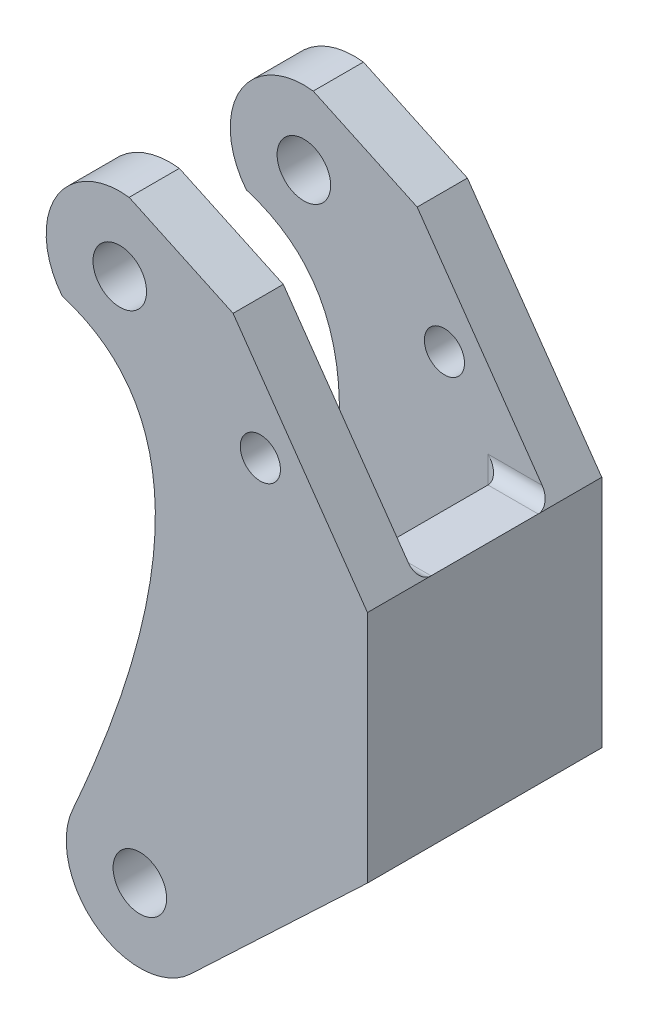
ISO-10303-21;
HEADER;
FILE_DESCRIPTION(('STEP AP214'),'2;1');
FILE_NAME('part.step','',(''),(''),'','','');
FILE_SCHEMA(('AUTOMOTIVE_DESIGN { 1 0 10303 214 1 1 1 1 }'));
ENDSEC;
DATA;
#1=APPLICATION_CONTEXT('core data for automotive mechanical design processes');
#2=APPLICATION_PROTOCOL_DEFINITION('international standard','automotive_design',2000,#1);
#3=PRODUCT_CONTEXT('',#1,'mechanical');
#4=PRODUCT('Part','Part','',(#3));
#5=PRODUCT_RELATED_PRODUCT_CATEGORY('part','',(#4));
#6=PRODUCT_DEFINITION_FORMATION('','',#4);
#7=PRODUCT_DEFINITION_CONTEXT('part definition',#1,'design');
#8=PRODUCT_DEFINITION('design','',#6,#7);
#9=PRODUCT_DEFINITION_SHAPE('','',#8);
#10=(LENGTH_UNIT() NAMED_UNIT(*) SI_UNIT(.MILLI.,.METRE.));
#11=(NAMED_UNIT(*) PLANE_ANGLE_UNIT() SI_UNIT($,.RADIAN.));
#12=(NAMED_UNIT(*) SI_UNIT($,.STERADIAN.) SOLID_ANGLE_UNIT());
#13=UNCERTAINTY_MEASURE_WITH_UNIT(LENGTH_MEASURE(1.E-05),#10,'distance_accuracy_value','');
#14=(GEOMETRIC_REPRESENTATION_CONTEXT(3) GLOBAL_UNCERTAINTY_ASSIGNED_CONTEXT((#13)) GLOBAL_UNIT_ASSIGNED_CONTEXT((#10,
#11,#12)) REPRESENTATION_CONTEXT('',''));
#15=CARTESIAN_POINT('',(0.,0.,0.));
#16=DIRECTION('',(0.,0.,1.));
#17=DIRECTION('',(1.,0.,0.));
#18=AXIS2_PLACEMENT_3D('',#15,#16,#17);
#19=CARTESIAN_POINT('',(-733376.145202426,-679839.483721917,35.));
#20=CARTESIAN_POINT('',(729354.890660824,684144.097201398,35.));
#21=CARTESIAN_POINT('',(-725481.74701469,-688256.591366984,35.));
#22=B_SPLINE_CURVE_WITH_KNOTS('',2,(#19,#20,#21),.UNSPECIFIED.,.F.,.F.,(3,3),(0.,1.),.UNSPECIFIED.);
#23=DIRECTION('',(0.,0.,-1.));
#24=VECTOR('',#23,1.);
#25=SURFACE_OF_LINEAR_EXTRUSION('',#22,#24);
#26=CARTESIAN_POINT('',(-733376.145202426,-679839.483721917,27.5));
#27=CARTESIAN_POINT('',(729354.890660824,684144.097201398,27.5));
#28=CARTESIAN_POINT('',(-725481.74701469,-688256.591366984,27.5));
#29=B_SPLINE_CURVE_WITH_KNOTS('',2,(#26,#27,#28),.UNSPECIFIED.,.F.,.F.,(3,3),(0.,1.),.UNSPECIFIED.);
#30=CARTESIAN_POINT('',(-45.5921431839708,53.1315885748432,27.5));
#31=VERTEX_POINT('',#30);
#32=CARTESIAN_POINT('',(-44.033482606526,-12.4912056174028,27.5));
#33=VERTEX_POINT('',#32);
#34=EDGE_CURVE('E233',#31,#33,#29,.T.);
#35=ORIENTED_EDGE('',*,*,#34,.T.);
#36=DIRECTION('',(0.,0.,-1.));
#37=VECTOR('',#36,1.);
#38=CARTESIAN_POINT('',(-44.0334826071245,-12.4912056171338,35.));
#39=LINE('',#38,#37);
#40=CARTESIAN_POINT('',(-44.0334826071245,-12.4912056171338,35.));
#41=VERTEX_POINT('',#40);
#42=EDGE_CURVE('E206',#41,#33,#39,.T.);
#43=ORIENTED_EDGE('',*,*,#42,.F.);
#44=CARTESIAN_POINT('',(-45.5921431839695,53.1315885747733,35.));
#45=VERTEX_POINT('',#44);
#46=EDGE_CURVE('E196',#45,#41,#22,.T.);
#47=ORIENTED_EDGE('',*,*,#46,.F.);
#48=DIRECTION('',(0.,0.,-1.));
#49=VECTOR('',#48,1.);
#50=CARTESIAN_POINT('',(-45.5921431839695,53.1315885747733,35.));
#51=LINE('',#50,#49);
#52=EDGE_CURVE('E213',#45,#31,#51,.T.);
#53=ORIENTED_EDGE('',*,*,#52,.T.);
#54=EDGE_LOOP('',(#35,#43,#47,#53));
#55=FACE_BOUND('',#54,.T.);
#56=ADVANCED_FACE('F31',(#55),#25,.F.);
#57=CARTESIAN_POINT('',(0.,0.,35.));
#58=DIRECTION('',(-0.686903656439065,0.726748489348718,0.));
#59=DIRECTION('',(-0.726748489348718,-0.686903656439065,0.));
#60=AXIS2_PLACEMENT_3D('',#57,#58,#59);
#61=PLANE('',#60);
#62=DIRECTION('',(0.,0.,-1.));
#63=VECTOR('',#62,1.);
#64=CARTESIAN_POINT('',(-26.4440597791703,-24.9942333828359,35.));
#65=LINE('',#64,#63);
#66=CARTESIAN_POINT('',(-26.4440597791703,-24.9942333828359,35.));
#67=VERTEX_POINT('',#66);
#68=CARTESIAN_POINT('',(-26.4440597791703,-24.9942333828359,27.5));
#69=VERTEX_POINT('',#68);
#70=EDGE_CURVE('E195',#67,#69,#65,.T.);
#71=ORIENTED_EDGE('',*,*,#70,.T.);
#72=DIRECTION('',(0.726748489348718,0.686903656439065,0.));
#73=VECTOR('',#72,1.);
#74=CARTESIAN_POINT('',(0.,0.,27.5));
#75=LINE('',#74,#73);
#76=CARTESIAN_POINT('',(-2.11601287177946,-2.,27.5));
#77=VERTEX_POINT('',#76);
#78=EDGE_CURVE('E418',#69,#77,#75,.T.);
#79=ORIENTED_EDGE('',*,*,#78,.T.);
#80=CARTESIAN_POINT('',(-2.11601287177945,-2.,25.5));
#81=DIRECTION('',(-0.686903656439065,0.726748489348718,0.));
#82=DIRECTION('',(-0.726748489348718,-0.686903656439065,0.));
#83=AXIS2_PLACEMENT_3D('',#80,#81,#82);
#84=ELLIPSE('',#83,2.91161647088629,2.);
#85=CARTESIAN_POINT('',(0.,0.,25.5));
#86=VERTEX_POINT('',#85);
#87=EDGE_CURVE('E286',#77,#86,#84,.T.);
#88=ORIENTED_EDGE('',*,*,#87,.T.);
#89=DIRECTION('',(0.,0.,-1.));
#90=VECTOR('',#89,1.);
#91=CARTESIAN_POINT('',(0.,0.,35.));
#92=LINE('',#91,#90);
#93=CARTESIAN_POINT('',(0.,0.,35.));
#94=VERTEX_POINT('',#93);
#95=EDGE_CURVE('E227',#94,#86,#92,.T.);
#96=ORIENTED_EDGE('',*,*,#95,.F.);
#97=DIRECTION('',(0.726748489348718,0.686903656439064,0.));
#98=VECTOR('',#97,1.);
#99=CARTESIAN_POINT('',(0.,0.,35.));
#100=LINE('',#99,#98);
#101=EDGE_CURVE('E338',#67,#94,#100,.T.);
#102=ORIENTED_EDGE('',*,*,#101,.F.);
#103=EDGE_LOOP('',(#71,#79,#88,#96,#102));
#104=FACE_BOUND('',#103,.T.);
#105=ADVANCED_FACE('F381',(#104),#61,.F.);
#106=CARTESIAN_POINT('',(-34.,-17.,35.));
#107=DIRECTION('',(0.,0.,-1.));
#108=DIRECTION('',(-1.,0.,0.));
#109=AXIS2_PLACEMENT_3D('',#106,#107,#108);
#110=CYLINDRICAL_SURFACE('',#109,11.);
#111=ORIENTED_EDGE('',*,*,#42,.T.);
#112=CARTESIAN_POINT('',(-34.,-17.,27.5));
#113=DIRECTION('',(0.,0.,1.));
#114=DIRECTION('',(1.,0.,0.));
#115=AXIS2_PLACEMENT_3D('',#112,#113,#114);
#116=CIRCLE('',#115,11.);
#117=EDGE_CURVE('E245',#33,#69,#116,.T.);
#118=ORIENTED_EDGE('',*,*,#117,.T.);
#119=ORIENTED_EDGE('',*,*,#70,.F.);
#120=CARTESIAN_POINT('',(-34.,-17.,35.));
#121=DIRECTION('',(0.,0.,1.));
#122=DIRECTION('',(1.,0.,0.));
#123=AXIS2_PLACEMENT_3D('',#120,#121,#122);
#124=CIRCLE('',#123,11.);
#125=EDGE_CURVE('E193',#41,#67,#124,.T.);
#126=ORIENTED_EDGE('',*,*,#125,.F.);
#127=EDGE_LOOP('',(#111,#118,#119,#126));
#128=FACE_BOUND('',#127,.T.);
#129=ADVANCED_FACE('F408',(#128),#110,.T.);
#130=CARTESIAN_POINT('',(0.,35.,35.));
#131=DIRECTION('',(-0.819152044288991,-0.573576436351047,0.));
#132=DIRECTION('',(0.573576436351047,-0.819152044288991,0.));
#133=AXIS2_PLACEMENT_3D('',#130,#131,#132);
#134=PLANE('',#133);
#135=DIRECTION('',(0.,0.,-1.));
#136=VECTOR('',#135,1.);
#137=CARTESIAN_POINT('',(0.,35.,35.));
#138=LINE('',#137,#136);
#139=CARTESIAN_POINT('',(0.,35.,35.));
#140=VERTEX_POINT('',#139);
#141=CARTESIAN_POINT('',(0.,35.,25.5));
#142=VERTEX_POINT('',#141);
#143=EDGE_CURVE('E224',#140,#142,#138,.T.);
#144=ORIENTED_EDGE('',*,*,#143,.T.);
#145=CARTESIAN_POINT('',(-1.40041507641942,37.,25.5));
#146=DIRECTION('',(-0.819152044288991,-0.573576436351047,0.));
#147=DIRECTION('',(-0.573576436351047,0.819152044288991,0.));
#148=AXIS2_PLACEMENT_3D('',#145,#146,#147);
#149=ELLIPSE('',#148,2.44154917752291,2.);
#150=CARTESIAN_POINT('',(-1.40041507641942,37.,27.5));
#151=VERTEX_POINT('',#150);
#152=EDGE_CURVE('E284',#142,#151,#149,.T.);
#153=ORIENTED_EDGE('',*,*,#152,.T.);
#154=DIRECTION('',(-0.573576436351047,0.819152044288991,0.));
#155=VECTOR('',#154,1.);
#156=CARTESIAN_POINT('',(0.,35.,27.5));
#157=LINE('',#156,#155);
#158=CARTESIAN_POINT('',(-20.0751752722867,63.6703215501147,27.5));
#159=VERTEX_POINT('',#158);
#160=EDGE_CURVE('E335',#151,#159,#157,.T.);
#161=ORIENTED_EDGE('',*,*,#160,.T.);
#162=DIRECTION('',(0.,0.,-1.));
#163=VECTOR('',#162,1.);
#164=CARTESIAN_POINT('',(-20.0751752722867,63.6703215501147,35.));
#165=LINE('',#164,#163);
#166=CARTESIAN_POINT('',(-20.0751752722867,63.6703215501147,35.));
#167=VERTEX_POINT('',#166);
#168=EDGE_CURVE('E221',#167,#159,#165,.T.);
#169=ORIENTED_EDGE('',*,*,#168,.F.);
#170=DIRECTION('',(-0.573576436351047,0.819152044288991,0.));
#171=VECTOR('',#170,1.);
#172=CARTESIAN_POINT('',(0.,35.,35.));
#173=LINE('',#172,#171);
#174=EDGE_CURVE('E343',#140,#167,#173,.T.);
#175=ORIENTED_EDGE('',*,*,#174,.F.);
#176=EDGE_LOOP('',(#144,#153,#161,#169,#175));
#177=FACE_BOUND('',#176,.T.);
#178=ADVANCED_FACE('F376',(#177),#134,.F.);
#179=CARTESIAN_POINT('',(-20.0751752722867,63.6703215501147,35.));
#180=DIRECTION('',(-0.422618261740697,-0.906307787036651,0.));
#181=DIRECTION('',(0.906307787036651,-0.422618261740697,0.));
#182=AXIS2_PLACEMENT_3D('',#179,#180,#181);
#183=PLANE('',#182);
#184=ORIENTED_EDGE('',*,*,#168,.T.);
#185=DIRECTION('',(-0.906307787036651,0.422618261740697,0.));
#186=VECTOR('',#185,1.);
#187=CARTESIAN_POINT('',(-20.0751752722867,63.6703215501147,27.5));
#188=LINE('',#187,#186);
#189=CARTESIAN_POINT('',(-35.6026001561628,70.9108786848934,27.5));
#190=VERTEX_POINT('',#189);
#191=EDGE_CURVE('E327',#159,#190,#188,.T.);
#192=ORIENTED_EDGE('',*,*,#191,.T.);
#193=DIRECTION('',(0.,0.,-1.));
#194=VECTOR('',#193,1.);
#195=CARTESIAN_POINT('',(-35.6026001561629,70.9108786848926,35.));
#196=LINE('',#195,#194);
#197=CARTESIAN_POINT('',(-35.6026001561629,70.9108786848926,35.));
#198=VERTEX_POINT('',#197);
#199=EDGE_CURVE('E217',#198,#190,#196,.T.);
#200=ORIENTED_EDGE('',*,*,#199,.F.);
#201=DIRECTION('',(-0.906307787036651,0.422618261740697,0.));
#202=VECTOR('',#201,1.);
#203=CARTESIAN_POINT('',(-20.0751752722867,63.6703215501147,35.));
#204=LINE('',#203,#202);
#205=EDGE_CURVE('E345',#167,#198,#204,.T.);
#206=ORIENTED_EDGE('',*,*,#205,.F.);
#207=EDGE_LOOP('',(#184,#192,#200,#206));
#208=FACE_BOUND('',#207,.T.);
#209=ADVANCED_FACE('F372',(#208),#183,.F.);
#210=CARTESIAN_POINT('',(-37.,60.,35.));
#211=DIRECTION('',(0.,0.,-1.));
#212=DIRECTION('',(-1.,0.,0.));
#213=AXIS2_PLACEMENT_3D('',#210,#211,#212);
#214=CYLINDRICAL_SURFACE('',#213,11.0000000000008);
#215=CARTESIAN_POINT('',(-37.,60.,7.5));
#216=DIRECTION('',(0.,0.,-1.));
#217=DIRECTION('',(-1.,0.,0.));
#218=AXIS2_PLACEMENT_3D('',#215,#216,#217);
#219=CIRCLE('',#218,11.0000000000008);
#220=CARTESIAN_POINT('',(-45.5921431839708,53.1315885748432,7.5));
#221=VERTEX_POINT('',#220);
#222=CARTESIAN_POINT('',(-35.6026001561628,70.9108786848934,7.5));
#223=VERTEX_POINT('',#222);
#224=EDGE_CURVE('E329',#221,#223,#219,.T.);
#225=ORIENTED_EDGE('',*,*,#224,.T.);
#226=CARTESIAN_POINT('',(-35.6026001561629,70.9108786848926,0.));
#227=VERTEX_POINT('',#226);
#228=EDGE_CURVE('E216',#223,#227,#196,.T.);
#229=ORIENTED_EDGE('',*,*,#228,.T.);
#230=CARTESIAN_POINT('',(-37.,60.,0.));
#231=DIRECTION('',(0.,0.,1.));
#232=DIRECTION('',(1.,0.,0.));
#233=AXIS2_PLACEMENT_3D('',#230,#231,#232);
#234=CIRCLE('',#233,11.0000000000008);
#235=CARTESIAN_POINT('',(-45.5921431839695,53.1315885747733,0.));
#236=VERTEX_POINT('',#235);
#237=EDGE_CURVE('E459',#227,#236,#234,.T.);
#238=ORIENTED_EDGE('',*,*,#237,.T.);
#239=EDGE_CURVE('E211',#221,#236,#51,.T.);
#240=ORIENTED_EDGE('',*,*,#239,.F.);
#241=EDGE_LOOP('',(#225,#229,#238,#240));
#242=FACE_BOUND('',#241,.T.);
#243=ADVANCED_FACE('F368',(#242),#214,.T.);
#244=CARTESIAN_POINT('',(-26.4440597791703,-24.9942333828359,7.5));
#245=VERTEX_POINT('',#244);
#246=CARTESIAN_POINT('',(-26.4440597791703,-24.9942333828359,6.25));
#247=VERTEX_POINT('',#246);
#248=EDGE_CURVE('E186',#245,#247,#65,.T.);
#249=ORIENTED_EDGE('',*,*,#248,.T.);
#250=CARTESIAN_POINT('',(-26.4440597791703,-24.9942333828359,3.75));
#251=DIRECTION('',(0.686903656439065,-0.726748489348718,0.));
#252=DIRECTION('',(0.726748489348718,0.686903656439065,0.));
#253=AXIS2_PLACEMENT_3D('',#250,#251,#252);
#254=CIRCLE('',#253,2.5);
#255=CARTESIAN_POINT('',(-26.4440597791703,-24.9942333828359,1.25));
#256=VERTEX_POINT('',#255);
#257=EDGE_CURVE('E47',#256,#247,#254,.T.);
#258=ORIENTED_EDGE('',*,*,#257,.F.);
#259=CARTESIAN_POINT('',(-26.4440597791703,-24.9942333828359,0.));
#260=VERTEX_POINT('',#259);
#261=EDGE_CURVE('E184',#256,#260,#65,.T.);
#262=ORIENTED_EDGE('',*,*,#261,.T.);
#263=DIRECTION('',(0.726748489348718,0.686903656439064,0.));
#264=VECTOR('',#263,1.);
#265=CARTESIAN_POINT('',(0.,0.,0.));
#266=LINE('',#265,#264);
#267=CARTESIAN_POINT('',(0.,0.,0.));
#268=VERTEX_POINT('',#267);
#269=EDGE_CURVE('E337',#260,#268,#266,.T.);
#270=ORIENTED_EDGE('',*,*,#269,.T.);
#271=CARTESIAN_POINT('',(0.,0.,9.5));
#272=VERTEX_POINT('',#271);
#273=EDGE_CURVE('E226',#272,#268,#92,.T.);
#274=ORIENTED_EDGE('',*,*,#273,.F.);
#275=CARTESIAN_POINT('',(-2.11601287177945,-2.,9.5));
#276=DIRECTION('',(-0.686903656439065,0.726748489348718,0.));
#277=DIRECTION('',(-0.726748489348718,-0.686903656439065,0.));
#278=AXIS2_PLACEMENT_3D('',#275,#276,#277);
#279=ELLIPSE('',#278,2.91161647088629,2.);
#280=CARTESIAN_POINT('',(-2.11601287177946,-2.,7.5));
#281=VERTEX_POINT('',#280);
#282=EDGE_CURVE('E40',#272,#281,#279,.T.);
#283=ORIENTED_EDGE('',*,*,#282,.T.);
#284=DIRECTION('',(-0.726748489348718,-0.686903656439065,0.));
#285=VECTOR('',#284,1.);
#286=CARTESIAN_POINT('',(0.,0.,7.5));
#287=LINE('',#286,#285);
#288=EDGE_CURVE('E442',#281,#245,#287,.T.);
#289=ORIENTED_EDGE('',*,*,#288,.T.);
#290=EDGE_LOOP('',(#249,#258,#262,#270,#274,#283,#289));
#291=FACE_BOUND('',#290,.T.);
#292=ADVANCED_FACE('F182',(#291),#61,.F.);
#293=CARTESIAN_POINT('',(0.,0.,35.));
#294=DIRECTION('',(-1.,0.,0.));
#295=DIRECTION('',(0.,0.,1.));
#296=AXIS2_PLACEMENT_3D('',#293,#294,#295);
#297=PLANE('',#296);
#298=DIRECTION('',(0.,1.,0.));
#299=VECTOR('',#298,1.);
#300=CARTESIAN_POINT('',(0.,0.,0.));
#301=LINE('',#300,#299);
#302=CARTESIAN_POINT('',(0.,35.,0.));
#303=VERTEX_POINT('',#302);
#304=EDGE_CURVE('E474',#268,#303,#301,.T.);
#305=ORIENTED_EDGE('',*,*,#304,.T.);
#306=CARTESIAN_POINT('',(0.,35.,9.5));
#307=VERTEX_POINT('',#306);
#308=EDGE_CURVE('E55',#307,#303,#138,.T.);
#309=ORIENTED_EDGE('',*,*,#308,.F.);
#310=DIRECTION('',(0.,0.,-1.));
#311=VECTOR('',#310,1.);
#312=CARTESIAN_POINT('',(0.,35.,27.5));
#313=LINE('',#312,#311);
#314=EDGE_CURVE('E441',#142,#307,#313,.T.);
#315=ORIENTED_EDGE('',*,*,#314,.F.);
#316=ORIENTED_EDGE('',*,*,#143,.F.);
#317=DIRECTION('',(0.,1.,0.));
#318=VECTOR('',#317,1.);
#319=CARTESIAN_POINT('',(0.,0.,35.));
#320=LINE('',#319,#318);
#321=EDGE_CURVE('E341',#94,#140,#320,.T.);
#322=ORIENTED_EDGE('',*,*,#321,.F.);
#323=ORIENTED_EDGE('',*,*,#95,.T.);
#324=DIRECTION('',(0.,0.,1.));
#325=VECTOR('',#324,1.);
#326=CARTESIAN_POINT('',(0.,0.,27.5));
#327=LINE('',#326,#325);
#328=EDGE_CURVE('E445',#272,#86,#327,.T.);
#329=ORIENTED_EDGE('',*,*,#328,.F.);
#330=ORIENTED_EDGE('',*,*,#273,.T.);
#331=EDGE_LOOP('',(#305,#309,#315,#316,#322,#323,#329,#330));
#332=FACE_BOUND('',#331,.T.);
#333=ADVANCED_FACE('F375',(#332),#297,.F.);
#334=CARTESIAN_POINT('',(-20.0751752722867,63.6703215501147,7.5));
#335=VERTEX_POINT('',#334);
#336=CARTESIAN_POINT('',(-20.0751752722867,63.6703215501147,0.));
#337=VERTEX_POINT('',#336);
#338=EDGE_CURVE('E220',#335,#337,#165,.T.);
#339=ORIENTED_EDGE('',*,*,#338,.F.);
#340=DIRECTION('',(0.573576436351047,-0.819152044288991,0.));
#341=VECTOR('',#340,1.);
#342=CARTESIAN_POINT('',(0.,35.,7.5));
#343=LINE('',#342,#341);
#344=CARTESIAN_POINT('',(-1.40041507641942,37.,7.5));
#345=VERTEX_POINT('',#344);
#346=EDGE_CURVE('E318',#335,#345,#343,.T.);
#347=ORIENTED_EDGE('',*,*,#346,.T.);
#348=CARTESIAN_POINT('',(-1.40041507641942,37.,9.5));
#349=DIRECTION('',(-0.819152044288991,-0.573576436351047,0.));
#350=DIRECTION('',(-0.573576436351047,0.819152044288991,0.));
#351=AXIS2_PLACEMENT_3D('',#348,#349,#350);
#352=ELLIPSE('',#351,2.44154917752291,2.);
#353=EDGE_CURVE('E11',#345,#307,#352,.T.);
#354=ORIENTED_EDGE('',*,*,#353,.T.);
#355=ORIENTED_EDGE('',*,*,#308,.T.);
#356=DIRECTION('',(-0.573576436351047,0.819152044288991,0.));
#357=VECTOR('',#356,1.);
#358=CARTESIAN_POINT('',(0.,35.,0.));
#359=LINE('',#358,#357);
#360=EDGE_CURVE('E460',#303,#337,#359,.T.);
#361=ORIENTED_EDGE('',*,*,#360,.T.);
#362=EDGE_LOOP('',(#339,#347,#354,#355,#361));
#363=FACE_BOUND('',#362,.T.);
#364=ADVANCED_FACE('F322',(#363),#134,.F.);
#365=ORIENTED_EDGE('',*,*,#228,.F.);
#366=DIRECTION('',(0.906307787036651,-0.422618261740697,0.));
#367=VECTOR('',#366,1.);
#368=CARTESIAN_POINT('',(-20.0751752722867,63.6703215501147,7.5));
#369=LINE('',#368,#367);
#370=EDGE_CURVE('E325',#223,#335,#369,.T.);
#371=ORIENTED_EDGE('',*,*,#370,.T.);
#372=ORIENTED_EDGE('',*,*,#338,.T.);
#373=DIRECTION('',(-0.906307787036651,0.422618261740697,0.));
#374=VECTOR('',#373,1.);
#375=CARTESIAN_POINT('',(-20.0751752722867,63.6703215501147,0.));
#376=LINE('',#375,#374);
#377=EDGE_CURVE('E455',#337,#227,#376,.T.);
#378=ORIENTED_EDGE('',*,*,#377,.T.);
#379=EDGE_LOOP('',(#365,#371,#372,#378));
#380=FACE_BOUND('',#379,.T.);
#381=ADVANCED_FACE('F366',(#380),#183,.F.);
#382=CARTESIAN_POINT('',(-37.,60.,27.5));
#383=DIRECTION('',(0.,0.,1.));
#384=DIRECTION('',(1.,0.,0.));
#385=AXIS2_PLACEMENT_3D('',#382,#383,#384);
#386=CIRCLE('',#385,11.0000000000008);
#387=EDGE_CURVE('E324',#190,#31,#386,.T.);
#388=ORIENTED_EDGE('',*,*,#387,.T.);
#389=ORIENTED_EDGE('',*,*,#52,.F.);
#390=CARTESIAN_POINT('',(-37.,60.,35.));
#391=DIRECTION('',(0.,0.,1.));
#392=DIRECTION('',(1.,0.,0.));
#393=AXIS2_PLACEMENT_3D('',#390,#391,#392);
#394=CIRCLE('',#393,11.0000000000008);
#395=EDGE_CURVE('E347',#198,#45,#394,.T.);
#396=ORIENTED_EDGE('',*,*,#395,.F.);
#397=ORIENTED_EDGE('',*,*,#199,.T.);
#398=EDGE_LOOP('',(#388,#389,#396,#397));
#399=FACE_BOUND('',#398,.T.);
#400=ADVANCED_FACE('F361',(#399),#214,.T.);
#401=CARTESIAN_POINT('',(-44.0334826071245,-12.4912056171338,7.5));
#402=VERTEX_POINT('',#401);
#403=CARTESIAN_POINT('',(-44.0334826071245,-12.4912056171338,0.));
#404=VERTEX_POINT('',#403);
#405=EDGE_CURVE('E201',#402,#404,#39,.T.);
#406=ORIENTED_EDGE('',*,*,#405,.F.);
#407=CARTESIAN_POINT('',(-733376.145202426,-679839.483721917,7.5));
#408=CARTESIAN_POINT('',(729354.890660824,684144.097201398,7.5));
#409=CARTESIAN_POINT('',(-725481.74701469,-688256.591366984,7.5));
#410=B_SPLINE_CURVE_WITH_KNOTS('',2,(#407,#408,#409),.UNSPECIFIED.,.F.,.F.,(3,3),(0.,1.),.UNSPECIFIED.);
#411=EDGE_CURVE('E229',#402,#221,#410,.F.);
#412=ORIENTED_EDGE('',*,*,#411,.T.);
#413=ORIENTED_EDGE('',*,*,#239,.T.);
#414=CARTESIAN_POINT('',(-733376.145202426,-679839.483721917,0.));
#415=CARTESIAN_POINT('',(729354.890660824,684144.097201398,0.));
#416=CARTESIAN_POINT('',(-725481.74701469,-688256.591366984,0.));
#417=B_SPLINE_CURVE_WITH_KNOTS('',2,(#414,#415,#416),.UNSPECIFIED.,.F.,.F.,(3,3),(0.,1.),.UNSPECIFIED.);
#418=EDGE_CURVE('E464',#236,#404,#417,.T.);
#419=ORIENTED_EDGE('',*,*,#418,.T.);
#420=EDGE_LOOP('',(#406,#412,#413,#419));
#421=FACE_BOUND('',#420,.T.);
#422=ADVANCED_FACE('F357',(#421),#25,.F.);
#423=ORIENTED_EDGE('',*,*,#261,.F.);
#424=CARTESIAN_POINT('',(-26.4440597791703,-24.9942333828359,6.25));
#425=CARTESIAN_POINT('',(-26.4944678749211,-25.0418864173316,6.25000773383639));
#426=CARTESIAN_POINT('',(-26.5453320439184,-25.0890506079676,6.24711302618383));
#427=CARTESIAN_POINT('',(-26.6475740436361,-25.1820885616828,6.23557870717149));
#428=CARTESIAN_POINT('',(-26.6989518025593,-25.2279625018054,6.2269398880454));
#429=CARTESIAN_POINT('',(-26.8017489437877,-25.3180436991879,6.20399686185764));
#430=CARTESIAN_POINT('',(-26.8531681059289,-25.3622536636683,6.18970233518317));
#431=CARTESIAN_POINT('',(-26.9557085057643,-25.4488146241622,6.15557718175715));
#432=CARTESIAN_POINT('',(-27.0068297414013,-25.4911656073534,6.13574651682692));
#433=CARTESIAN_POINT('',(-27.159131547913,-25.6150781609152,6.06815532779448));
#434=CARTESIAN_POINT('',(-27.2593389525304,-25.6935766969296,6.01227568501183));
#435=CARTESIAN_POINT('',(-27.4535747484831,-25.8407706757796,5.88059094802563));
#436=CARTESIAN_POINT('',(-27.5476021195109,-25.9094645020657,5.80478257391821));
#437=CARTESIAN_POINT('',(-27.7276749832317,-26.03716276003,5.63400285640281));
#438=CARTESIAN_POINT('',(-27.8135759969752,-26.0960024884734,5.53875553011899));
#439=CARTESIAN_POINT('',(-27.9725321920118,-26.2021079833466,5.33238964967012));
#440=CARTESIAN_POINT('',(-28.0455851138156,-26.2493717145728,5.22126831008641));
#441=CARTESIAN_POINT('',(-28.1767029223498,-26.3324877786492,4.98466486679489));
#442=CARTESIAN_POINT('',(-28.2345772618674,-26.3681962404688,4.85902631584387));
#443=CARTESIAN_POINT('',(-28.3315755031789,-26.4272057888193,4.5979832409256));
#444=CARTESIAN_POINT('',(-28.3707028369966,-26.4505091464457,4.46258050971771));
#445=CARTESIAN_POINT('',(-28.4278444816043,-26.4843121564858,4.18824239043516));
#446=CARTESIAN_POINT('',(-28.446200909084,-26.4950193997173,4.04940393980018));
#447=CARTESIAN_POINT('',(-28.4620562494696,-26.5042763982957,3.77014500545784));
#448=CARTESIAN_POINT('',(-28.4595574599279,-26.5028274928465,3.62972469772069));
#449=CARTESIAN_POINT('',(-28.4340916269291,-26.487932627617,3.35422655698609));
#450=CARTESIAN_POINT('',(-28.4115301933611,-26.4747244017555,3.21909798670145));
#451=CARTESIAN_POINT('',(-28.3475647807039,-26.4367021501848,2.95508445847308));
#452=CARTESIAN_POINT('',(-28.306159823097,-26.4118875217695,2.8261998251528));
#453=CARTESIAN_POINT('',(-28.2059144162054,-26.3505100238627,2.57705759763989));
#454=CARTESIAN_POINT('',(-28.1469279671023,-26.3138485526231,2.45688315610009));
#455=CARTESIAN_POINT('',(-28.0140993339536,-26.2290402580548,2.22949445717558));
#456=CARTESIAN_POINT('',(-27.9402553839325,-26.1808920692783,2.12228174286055));
#457=CARTESIAN_POINT('',(-27.7786660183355,-26.0721929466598,1.92123374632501));
#458=CARTESIAN_POINT('',(-27.6906368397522,-26.0113792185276,1.82776827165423));
#459=CARTESIAN_POINT('',(-27.5052356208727,-25.878682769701,1.65981207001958));
#460=CARTESIAN_POINT('',(-27.4078611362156,-25.8067971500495,1.58532632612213));
#461=CARTESIAN_POINT('',(-27.2069874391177,-25.6528054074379,1.45733768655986));
#462=CARTESIAN_POINT('',(-27.1034708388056,-25.5706694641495,1.40389798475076));
#463=CARTESIAN_POINT('',(-26.8942509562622,-25.3980136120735,1.32007427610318));
#464=CARTESIAN_POINT('',(-26.788551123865,-25.3075062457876,1.28965638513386));
#465=CARTESIAN_POINT('',(-26.6433346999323,-25.1781673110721,1.26415157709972));
#466=CARTESIAN_POINT('',(-26.6031648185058,-25.141853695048,1.25884327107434));
#467=CARTESIAN_POINT('',(-26.5232641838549,-25.0685406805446,1.25177173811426));
#468=CARTESIAN_POINT('',(-26.4835328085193,-25.0315425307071,1.25000259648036));
#469=CARTESIAN_POINT('',(-26.4440597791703,-24.9942333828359,1.24999999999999));
#470=B_SPLINE_CURVE_WITH_KNOTS('',3,(#424,#425,#426,#427,#428,#429,#430,#431,#432,#433,#434,
#435,#436,#437,#438,#439,#440,#441,#442,#443,#444,#445,#446,#447,#448,#449,#450,#451,#452,#453,
#454,#455,#456,#457,#458,#459,#460,#461,#462,#463,#464,#465,#466,#467,#468,#469),.UNSPECIFIED.,
.F.,.F.,(4,2,2,2,2,2,2,2,2,2,2,2,2,2,2,2,2,2,2,2,2,2,4),(0.,0.208030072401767,0.416031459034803,
0.623678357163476,0.831326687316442,1.2462696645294,1.66128097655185,2.08265515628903,
2.50410336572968,2.93061326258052,3.35704504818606,3.77634591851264,4.19560059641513,
4.60656710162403,5.01755495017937,5.43205559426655,5.8466055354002,6.27081242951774,
6.69513058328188,7.12071327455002,7.54566835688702,7.70880366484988,7.87166611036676),.UNSPECIFIED.);
#471=EDGE_CURVE('E174',#247,#256,#470,.T.);
#472=ORIENTED_EDGE('',*,*,#471,.F.);
#473=ORIENTED_EDGE('',*,*,#248,.F.);
#474=CARTESIAN_POINT('',(-34.,-17.,7.5));
#475=DIRECTION('',(0.,0.,-1.));
#476=DIRECTION('',(-1.,0.,0.));
#477=AXIS2_PLACEMENT_3D('',#474,#475,#476);
#478=CIRCLE('',#477,11.);
#479=EDGE_CURVE('E240',#245,#402,#478,.T.);
#480=ORIENTED_EDGE('',*,*,#479,.T.);
#481=ORIENTED_EDGE('',*,*,#405,.T.);
#482=CARTESIAN_POINT('',(-34.,-17.,0.));
#483=DIRECTION('',(0.,0.,1.));
#484=DIRECTION('',(1.,0.,0.));
#485=AXIS2_PLACEMENT_3D('',#482,#483,#484);
#486=CIRCLE('',#485,11.);
#487=EDGE_CURVE('E191',#404,#260,#486,.T.);
#488=ORIENTED_EDGE('',*,*,#487,.T.);
#489=EDGE_LOOP('',(#423,#472,#473,#480,#481,#488));
#490=FACE_BOUND('',#489,.T.);
#491=ADVANCED_FACE('F189',(#490),#110,.T.);
#492=CARTESIAN_POINT('',(-34.,-17.,35.));
#493=DIRECTION('',(0.,0.,1.));
#494=DIRECTION('',(1.,0.,0.));
#495=AXIS2_PLACEMENT_3D('',#492,#493,#494);
#496=PLANE('',#495);
#497=CARTESIAN_POINT('',(-16.,47.,35.));
#498=DIRECTION('',(0.,0.,1.));
#499=DIRECTION('',(1.,0.,0.));
#500=AXIS2_PLACEMENT_3D('',#497,#498,#499);
#501=CIRCLE('',#500,3.);
#502=CARTESIAN_POINT('',(-13.,47.,35.));
#503=VERTEX_POINT('',#502);
#504=EDGE_CURVE('E502',#503,#503,#501,.T.);
#505=ORIENTED_EDGE('',*,*,#504,.F.);
#506=EDGE_LOOP('',(#505));
#507=FACE_BOUND('',#506,.T.);
#508=CARTESIAN_POINT('',(-34.,-17.,35.));
#509=DIRECTION('',(0.,0.,-1.));
#510=DIRECTION('',(-1.,0.,0.));
#511=AXIS2_PLACEMENT_3D('',#508,#509,#510);
#512=CIRCLE('',#511,4.00000000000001);
#513=CARTESIAN_POINT('',(-38.,-17.,35.));
#514=VERTEX_POINT('',#513);
#515=EDGE_CURVE('E258',#514,#514,#512,.T.);
#516=ORIENTED_EDGE('',*,*,#515,.T.);
#517=EDGE_LOOP('',(#516));
#518=FACE_BOUND('',#517,.T.);
#519=CARTESIAN_POINT('',(-37.,60.,35.));
#520=DIRECTION('',(0.,0.,-1.));
#521=DIRECTION('',(-1.,0.,0.));
#522=AXIS2_PLACEMENT_3D('',#519,#520,#521);
#523=CIRCLE('',#522,4.00000000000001);
#524=CARTESIAN_POINT('',(-41.,60.,35.));
#525=VERTEX_POINT('',#524);
#526=EDGE_CURVE('E253',#525,#525,#523,.T.);
#527=ORIENTED_EDGE('',*,*,#526,.T.);
#528=EDGE_LOOP('',(#527));
#529=FACE_BOUND('',#528,.T.);
#530=ORIENTED_EDGE('',*,*,#101,.T.);
#531=ORIENTED_EDGE('',*,*,#321,.T.);
#532=ORIENTED_EDGE('',*,*,#174,.T.);
#533=ORIENTED_EDGE('',*,*,#205,.T.);
#534=ORIENTED_EDGE('',*,*,#395,.T.);
#535=ORIENTED_EDGE('',*,*,#46,.T.);
#536=ORIENTED_EDGE('',*,*,#125,.T.);
#537=EDGE_LOOP('',(#530,#531,#532,#533,#534,#535,#536));
#538=FACE_BOUND('',#537,.T.);
#539=ADVANCED_FACE('F421',(#507,#518,#529,#538),#496,.T.);
#540=CARTESIAN_POINT('',(-34.,-17.,0.));
#541=DIRECTION('',(0.,0.,1.));
#542=DIRECTION('',(1.,0.,0.));
#543=AXIS2_PLACEMENT_3D('',#540,#541,#542);
#544=PLANE('',#543);
#545=CARTESIAN_POINT('',(-16.,47.,0.));
#546=DIRECTION('',(0.,0.,1.));
#547=DIRECTION('',(1.,0.,0.));
#548=AXIS2_PLACEMENT_3D('',#545,#546,#547);
#549=CIRCLE('',#548,3.);
#550=CARTESIAN_POINT('',(-13.,47.,0.));
#551=VERTEX_POINT('',#550);
#552=EDGE_CURVE('E505',#551,#551,#549,.T.);
#553=ORIENTED_EDGE('',*,*,#552,.T.);
#554=EDGE_LOOP('',(#553));
#555=FACE_BOUND('',#554,.T.);
#556=CARTESIAN_POINT('',(-34.,-17.,0.));
#557=DIRECTION('',(0.,0.,-1.));
#558=DIRECTION('',(-1.,0.,0.));
#559=AXIS2_PLACEMENT_3D('',#556,#557,#558);
#560=CIRCLE('',#559,4.00000000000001);
#561=CARTESIAN_POINT('',(-38.,-17.,0.));
#562=VERTEX_POINT('',#561);
#563=EDGE_CURVE('E297',#562,#562,#560,.T.);
#564=ORIENTED_EDGE('',*,*,#563,.F.);
#565=EDGE_LOOP('',(#564));
#566=FACE_BOUND('',#565,.T.);
#567=CARTESIAN_POINT('',(-37.,60.,0.));
#568=DIRECTION('',(0.,0.,-1.));
#569=DIRECTION('',(-1.,0.,0.));
#570=AXIS2_PLACEMENT_3D('',#567,#568,#569);
#571=CIRCLE('',#570,4.00000000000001);
#572=CARTESIAN_POINT('',(-41.,60.,0.));
#573=VERTEX_POINT('',#572);
#574=EDGE_CURVE('E489',#573,#573,#571,.T.);
#575=ORIENTED_EDGE('',*,*,#574,.F.);
#576=EDGE_LOOP('',(#575));
#577=FACE_BOUND('',#576,.T.);
#578=ORIENTED_EDGE('',*,*,#269,.F.);
#579=ORIENTED_EDGE('',*,*,#487,.F.);
#580=ORIENTED_EDGE('',*,*,#418,.F.);
#581=ORIENTED_EDGE('',*,*,#237,.F.);
#582=ORIENTED_EDGE('',*,*,#377,.F.);
#583=ORIENTED_EDGE('',*,*,#360,.F.);
#584=ORIENTED_EDGE('',*,*,#304,.F.);
#585=EDGE_LOOP('',(#578,#579,#580,#581,#582,#583,#584));
#586=FACE_BOUND('',#585,.T.);
#587=ADVANCED_FACE('F463',(#555,#566,#577,#586),#544,.F.);
#588=CARTESIAN_POINT('',(-48.0000000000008,35.,27.5));
#589=DIRECTION('',(0.,0.,1.));
#590=DIRECTION('',(1.,0.,0.));
#591=AXIS2_PLACEMENT_3D('',#588,#589,#590);
#592=PLANE('',#591);
#593=CARTESIAN_POINT('',(-16.,47.,27.5));
#594=DIRECTION('',(0.,0.,1.));
#595=DIRECTION('',(1.,0.,0.));
#596=AXIS2_PLACEMENT_3D('',#593,#594,#595);
#597=CIRCLE('',#596,3.);
#598=CARTESIAN_POINT('',(-13.,47.,27.5));
#599=VERTEX_POINT('',#598);
#600=EDGE_CURVE('E300',#599,#599,#597,.T.);
#601=ORIENTED_EDGE('',*,*,#600,.T.);
#602=EDGE_LOOP('',(#601));
#603=FACE_BOUND('',#602,.T.);
#604=CARTESIAN_POINT('',(-34.,-17.,27.5));
#605=DIRECTION('',(0.,0.,1.));
#606=DIRECTION('',(1.,0.,0.));
#607=AXIS2_PLACEMENT_3D('',#604,#605,#606);
#608=CIRCLE('',#607,4.00000000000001);
#609=CARTESIAN_POINT('',(-30.,-17.,27.5));
#610=VERTEX_POINT('',#609);
#611=EDGE_CURVE('E257',#610,#610,#608,.T.);
#612=ORIENTED_EDGE('',*,*,#611,.T.);
#613=EDGE_LOOP('',(#612));
#614=FACE_BOUND('',#613,.T.);
#615=CARTESIAN_POINT('',(-37.,60.,27.5));
#616=DIRECTION('',(0.,0.,1.));
#617=DIRECTION('',(1.,0.,0.));
#618=AXIS2_PLACEMENT_3D('',#615,#616,#617);
#619=CIRCLE('',#618,4.00000000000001);
#620=CARTESIAN_POINT('',(-33.,60.,27.5));
#621=VERTEX_POINT('',#620);
#622=EDGE_CURVE('E252',#621,#621,#619,.T.);
#623=ORIENTED_EDGE('',*,*,#622,.T.);
#624=EDGE_LOOP('',(#623));
#625=FACE_BOUND('',#624,.T.);
#626=ORIENTED_EDGE('',*,*,#160,.F.);
#627=DIRECTION('',(1.,0.,0.));
#628=VECTOR('',#627,1.);
#629=CARTESIAN_POINT('',(-7.5,37.,27.5));
#630=LINE('',#629,#628);
#631=CARTESIAN_POINT('',(-9.5,37.,27.5));
#632=VERTEX_POINT('',#631);
#633=EDGE_CURVE('E267',#151,#632,#630,.F.);
#634=ORIENTED_EDGE('',*,*,#633,.T.);
#635=DIRECTION('',(0.,-1.,0.));
#636=VECTOR('',#635,1.);
#637=CARTESIAN_POINT('',(-9.5,0.,27.5));
#638=LINE('',#637,#636);
#639=CARTESIAN_POINT('',(-9.5,-2.,27.5));
#640=VERTEX_POINT('',#639);
#641=EDGE_CURVE('E265',#632,#640,#638,.T.);
#642=ORIENTED_EDGE('',*,*,#641,.T.);
#643=DIRECTION('',(1.,0.,0.));
#644=VECTOR('',#643,1.);
#645=CARTESIAN_POINT('',(0.,-2.,27.5));
#646=LINE('',#645,#644);
#647=EDGE_CURVE('E263',#640,#77,#646,.T.);
#648=ORIENTED_EDGE('',*,*,#647,.T.);
#649=ORIENTED_EDGE('',*,*,#78,.F.);
#650=ORIENTED_EDGE('',*,*,#117,.F.);
#651=ORIENTED_EDGE('',*,*,#34,.F.);
#652=ORIENTED_EDGE('',*,*,#387,.F.);
#653=ORIENTED_EDGE('',*,*,#191,.F.);
#654=EDGE_LOOP('',(#626,#634,#642,#648,#649,#650,#651,#652,#653));
#655=FACE_BOUND('',#654,.T.);
#656=ADVANCED_FACE('F417',(#603,#614,#625,#655),#592,.F.);
#657=CARTESIAN_POINT('',(-48.0000000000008,35.,7.5));
#658=DIRECTION('',(0.,0.,-1.));
#659=DIRECTION('',(-1.,0.,0.));
#660=AXIS2_PLACEMENT_3D('',#657,#658,#659);
#661=PLANE('',#660);
#662=CARTESIAN_POINT('',(-16.,47.,7.5));
#663=DIRECTION('',(0.,0.,-1.));
#664=DIRECTION('',(-1.,0.,0.));
#665=AXIS2_PLACEMENT_3D('',#662,#663,#664);
#666=CIRCLE('',#665,3.);
#667=CARTESIAN_POINT('',(-19.,47.,7.5));
#668=VERTEX_POINT('',#667);
#669=EDGE_CURVE('E35',#668,#668,#666,.T.);
#670=ORIENTED_EDGE('',*,*,#669,.T.);
#671=EDGE_LOOP('',(#670));
#672=FACE_BOUND('',#671,.T.);
#673=ORIENTED_EDGE('',*,*,#288,.F.);
#674=DIRECTION('',(1.,0.,0.));
#675=VECTOR('',#674,1.);
#676=CARTESIAN_POINT('',(-7.5,-2.,7.5));
#677=LINE('',#676,#675);
#678=CARTESIAN_POINT('',(-9.5,-2.,7.5));
#679=VERTEX_POINT('',#678);
#680=EDGE_CURVE('E282',#281,#679,#677,.F.);
#681=ORIENTED_EDGE('',*,*,#680,.T.);
#682=DIRECTION('',(0.,-1.,0.));
#683=VECTOR('',#682,1.);
#684=CARTESIAN_POINT('',(-9.5,35.,7.5));
#685=LINE('',#684,#683);
#686=CARTESIAN_POINT('',(-9.5,37.,7.5));
#687=VERTEX_POINT('',#686);
#688=EDGE_CURVE('E278',#679,#687,#685,.F.);
#689=ORIENTED_EDGE('',*,*,#688,.T.);
#690=DIRECTION('',(1.,0.,0.));
#691=VECTOR('',#690,1.);
#692=CARTESIAN_POINT('',(0.,37.,7.5));
#693=LINE('',#692,#691);
#694=EDGE_CURVE('E280',#687,#345,#693,.T.);
#695=ORIENTED_EDGE('',*,*,#694,.T.);
#696=ORIENTED_EDGE('',*,*,#346,.F.);
#697=ORIENTED_EDGE('',*,*,#370,.F.);
#698=ORIENTED_EDGE('',*,*,#224,.F.);
#699=ORIENTED_EDGE('',*,*,#411,.F.);
#700=ORIENTED_EDGE('',*,*,#479,.F.);
#701=EDGE_LOOP('',(#673,#681,#689,#695,#696,#697,#698,#699,#700));
#702=FACE_BOUND('',#701,.T.);
#703=CARTESIAN_POINT('',(-34.,-17.,7.5));
#704=DIRECTION('',(0.,0.,-1.));
#705=DIRECTION('',(-1.,0.,0.));
#706=AXIS2_PLACEMENT_3D('',#703,#704,#705);
#707=CIRCLE('',#706,4.00000000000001);
#708=CARTESIAN_POINT('',(-38.,-17.,7.5));
#709=VERTEX_POINT('',#708);
#710=EDGE_CURVE('E254',#709,#709,#707,.T.);
#711=ORIENTED_EDGE('',*,*,#710,.T.);
#712=EDGE_LOOP('',(#711));
#713=FACE_BOUND('',#712,.T.);
#714=CARTESIAN_POINT('',(-37.,60.,7.5));
#715=DIRECTION('',(0.,0.,-1.));
#716=DIRECTION('',(-1.,0.,0.));
#717=AXIS2_PLACEMENT_3D('',#714,#715,#716);
#718=CIRCLE('',#717,4.00000000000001);
#719=CARTESIAN_POINT('',(-41.,60.,7.5));
#720=VERTEX_POINT('',#719);
#721=EDGE_CURVE('E249',#720,#720,#718,.T.);
#722=ORIENTED_EDGE('',*,*,#721,.T.);
#723=EDGE_LOOP('',(#722));
#724=FACE_BOUND('',#723,.T.);
#725=ADVANCED_FACE('F315',(#672,#702,#713,#724),#661,.F.);
#726=CARTESIAN_POINT('',(-48.0000000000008,35.,27.5));
#727=DIRECTION('',(0.,-1.,0.));
#728=DIRECTION('',(0.,0.,-1.));
#729=AXIS2_PLACEMENT_3D('',#726,#727,#728);
#730=PLANE('',#729);
#731=DIRECTION('',(0.,0.,1.));
#732=VECTOR('',#731,1.);
#733=CARTESIAN_POINT('',(-7.5,35.,27.5));
#734=LINE('',#733,#732);
#735=CARTESIAN_POINT('',(-7.5,35.,9.5));
#736=VERTEX_POINT('',#735);
#737=CARTESIAN_POINT('',(-7.5,35.,25.5));
#738=VERTEX_POINT('',#737);
#739=EDGE_CURVE('E480',#736,#738,#734,.T.);
#740=ORIENTED_EDGE('',*,*,#739,.T.);
#741=DIRECTION('',(1.,0.,0.));
#742=VECTOR('',#741,1.);
#743=CARTESIAN_POINT('',(0.,35.,25.5));
#744=LINE('',#743,#742);
#745=EDGE_CURVE('E260',#738,#142,#744,.T.);
#746=ORIENTED_EDGE('',*,*,#745,.T.);
#747=ORIENTED_EDGE('',*,*,#314,.T.);
#748=DIRECTION('',(1.,0.,0.));
#749=VECTOR('',#748,1.);
#750=CARTESIAN_POINT('',(-7.5,35.,9.5));
#751=LINE('',#750,#749);
#752=EDGE_CURVE('E248',#307,#736,#751,.F.);
#753=ORIENTED_EDGE('',*,*,#752,.T.);
#754=EDGE_LOOP('',(#740,#746,#747,#753));
#755=FACE_BOUND('',#754,.T.);
#756=ADVANCED_FACE('F534',(#755),#730,.F.);
#757=CARTESIAN_POINT('',(-48.0000000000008,0.,27.5));
#758=DIRECTION('',(0.,1.,0.));
#759=DIRECTION('',(0.,0.,1.));
#760=AXIS2_PLACEMENT_3D('',#757,#758,#759);
#761=PLANE('',#760);
#762=ORIENTED_EDGE('',*,*,#328,.T.);
#763=DIRECTION('',(1.,0.,0.));
#764=VECTOR('',#763,1.);
#765=CARTESIAN_POINT('',(-7.5,0.,25.5));
#766=LINE('',#765,#764);
#767=CARTESIAN_POINT('',(-7.5,0.,25.5));
#768=VERTEX_POINT('',#767);
#769=EDGE_CURVE('E276',#86,#768,#766,.F.);
#770=ORIENTED_EDGE('',*,*,#769,.T.);
#771=DIRECTION('',(0.,0.,1.));
#772=VECTOR('',#771,1.);
#773=CARTESIAN_POINT('',(-7.5,0.,27.5));
#774=LINE('',#773,#772);
#775=CARTESIAN_POINT('',(-7.5,0.,9.5));
#776=VERTEX_POINT('',#775);
#777=EDGE_CURVE('E482',#776,#768,#774,.T.);
#778=ORIENTED_EDGE('',*,*,#777,.F.);
#779=DIRECTION('',(1.,0.,0.));
#780=VECTOR('',#779,1.);
#781=CARTESIAN_POINT('',(0.,0.,9.5));
#782=LINE('',#781,#780);
#783=EDGE_CURVE('E273',#776,#272,#782,.T.);
#784=ORIENTED_EDGE('',*,*,#783,.T.);
#785=EDGE_LOOP('',(#762,#770,#778,#784));
#786=FACE_BOUND('',#785,.T.);
#787=ADVANCED_FACE('F549',(#786),#761,.F.);
#788=CARTESIAN_POINT('',(-7.5,71.0000000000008,27.5));
#789=DIRECTION('',(1.,0.,0.));
#790=DIRECTION('',(0.,0.,-1.));
#791=AXIS2_PLACEMENT_3D('',#788,#789,#790);
#792=PLANE('',#791);
#793=ORIENTED_EDGE('',*,*,#777,.T.);
#794=DIRECTION('',(0.,-1.,0.));
#795=VECTOR('',#794,1.);
#796=CARTESIAN_POINT('',(-7.5,35.,25.5));
#797=LINE('',#796,#795);
#798=EDGE_CURVE('E271',#768,#738,#797,.F.);
#799=ORIENTED_EDGE('',*,*,#798,.T.);
#800=ORIENTED_EDGE('',*,*,#739,.F.);
#801=DIRECTION('',(0.,-1.,0.));
#802=VECTOR('',#801,1.);
#803=CARTESIAN_POINT('',(-7.5,0.,9.5));
#804=LINE('',#803,#802);
#805=EDGE_CURVE('E269',#736,#776,#804,.T.);
#806=ORIENTED_EDGE('',*,*,#805,.T.);
#807=EDGE_LOOP('',(#793,#799,#800,#806));
#808=FACE_BOUND('',#807,.T.);
#809=ADVANCED_FACE('F541',(#808),#792,.F.);
#810=CARTESIAN_POINT('',(-37.,60.,35.));
#811=DIRECTION('',(0.,0.,-1.));
#812=DIRECTION('',(-1.,0.,0.));
#813=AXIS2_PLACEMENT_3D('',#810,#811,#812);
#814=CYLINDRICAL_SURFACE('',#813,4.00000000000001);
#815=ORIENTED_EDGE('',*,*,#574,.T.);
#816=EDGE_LOOP('',(#815));
#817=FACE_BOUND('',#816,.T.);
#818=ORIENTED_EDGE('',*,*,#721,.F.);
#819=EDGE_LOOP('',(#818));
#820=FACE_BOUND('',#819,.T.);
#821=ADVANCED_FACE('F539',(#817,#820),#814,.F.);
#822=ORIENTED_EDGE('',*,*,#526,.F.);
#823=EDGE_LOOP('',(#822));
#824=FACE_BOUND('',#823,.T.);
#825=ORIENTED_EDGE('',*,*,#622,.F.);
#826=EDGE_LOOP('',(#825));
#827=FACE_BOUND('',#826,.T.);
#828=ADVANCED_FACE('F527',(#824,#827),#814,.F.);
#829=CARTESIAN_POINT('',(-34.,-17.,35.));
#830=DIRECTION('',(0.,0.,-1.));
#831=DIRECTION('',(-1.,0.,0.));
#832=AXIS2_PLACEMENT_3D('',#829,#830,#831);
#833=CYLINDRICAL_SURFACE('',#832,4.00000000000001);
#834=CARTESIAN_POINT('',(-30.038272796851,-17.5520122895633,3.75));
#835=CARTESIAN_POINT('',(-30.038272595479,-17.5520133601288,3.68784324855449));
#836=CARTESIAN_POINT('',(-30.0386801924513,-17.5549648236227,3.62567405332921));
#837=CARTESIAN_POINT('',(-30.0403384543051,-17.5666654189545,3.50188282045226));
#838=CARTESIAN_POINT('',(-30.0415896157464,-17.5754179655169,3.4402611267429));
#839=CARTESIAN_POINT('',(-30.0467239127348,-17.6100731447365,3.25677395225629));
#840=CARTESIAN_POINT('',(-30.0519881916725,-17.6443723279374,3.13645166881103));
#841=CARTESIAN_POINT('',(-30.0671954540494,-17.7313945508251,2.90440180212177));
#842=CARTESIAN_POINT('',(-30.0770980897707,-17.7839577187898,2.7926095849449));
#843=CARTESIAN_POINT('',(-30.102936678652,-17.9036867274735,2.57799147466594));
#844=CARTESIAN_POINT('',(-30.1188727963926,-17.9708529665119,2.47516582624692));
#845=CARTESIAN_POINT('',(-30.1608695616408,-18.1262211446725,2.26626601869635));
#846=CARTESIAN_POINT('',(-30.1880016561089,-18.2160363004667,2.16160667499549));
#847=CARTESIAN_POINT('',(-30.253918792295,-18.4060684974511,1.96623844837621));
#848=CARTESIAN_POINT('',(-30.2927139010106,-18.5062944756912,1.87554172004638));
#849=CARTESIAN_POINT('',(-30.389381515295,-18.7261105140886,1.69977970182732));
#850=CARTESIAN_POINT('',(-30.4489909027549,-18.8465779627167,1.61671381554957));
#851=CARTESIAN_POINT('',(-30.5523011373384,-19.0293617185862,1.50945484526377));
#852=CARTESIAN_POINT('',(-30.589066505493,-19.090654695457,1.47658486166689));
#853=CARTESIAN_POINT('',(-30.6673007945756,-19.2132293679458,1.41704531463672));
#854=CARTESIAN_POINT('',(-30.7087664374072,-19.2745110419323,1.39037146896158));
#855=CARTESIAN_POINT('',(-30.791902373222,-19.3901165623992,1.34601618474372));
#856=CARTESIAN_POINT('',(-30.8331275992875,-19.4445171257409,1.32769802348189));
#857=CARTESIAN_POINT('',(-30.9191333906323,-19.55205742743,1.29669771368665));
#858=CARTESIAN_POINT('',(-30.9639118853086,-19.6051978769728,1.28401231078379));
#859=CARTESIAN_POINT('',(-31.056733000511,-19.7096221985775,1.26448620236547));
#860=CARTESIAN_POINT('',(-31.104773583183,-19.7609071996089,1.25764188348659));
#861=CARTESIAN_POINT('',(-31.203715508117,-19.861076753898,1.24990078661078));
#862=CARTESIAN_POINT('',(-31.2546165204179,-19.9099615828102,1.24900332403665));
#863=CARTESIAN_POINT('',(-31.3968907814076,-20.0395103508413,1.25472537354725));
#864=CARTESIAN_POINT('',(-31.4906990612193,-20.1173403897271,1.26730650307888));
#865=CARTESIAN_POINT('',(-31.6823980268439,-20.2623937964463,1.30973021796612));
#866=CARTESIAN_POINT('',(-31.7802890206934,-20.3296163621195,1.33957410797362));
#867=CARTESIAN_POINT('',(-31.9772877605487,-20.4528496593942,1.41520855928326));
#868=CARTESIAN_POINT('',(-32.0763979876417,-20.508831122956,1.46103991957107));
#869=CARTESIAN_POINT('',(-32.2726635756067,-20.6095007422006,1.56693723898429));
#870=CARTESIAN_POINT('',(-32.3698184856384,-20.6541863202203,1.62700644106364));
#871=CARTESIAN_POINT('',(-32.5714318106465,-20.737986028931,1.76805641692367));
#872=CARTESIAN_POINT('',(-32.6752944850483,-20.7757147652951,1.85070927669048));
#873=CARTESIAN_POINT('',(-32.8740366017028,-20.8396789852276,2.03026473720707));
#874=CARTESIAN_POINT('',(-32.9689026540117,-20.8658975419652,2.12718804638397));
#875=CARTESIAN_POINT('',(-33.1575995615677,-20.9116433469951,2.34741125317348));
#876=CARTESIAN_POINT('',(-33.2496774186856,-20.9298496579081,2.47250276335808));
#877=CARTESIAN_POINT('',(-33.4113959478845,-20.9573092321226,2.73729223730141));
#878=CARTESIAN_POINT('',(-33.4810779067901,-20.9665790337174,2.8769626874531));
#879=CARTESIAN_POINT('',(-33.5762923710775,-20.9777051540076,3.12953880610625));
#880=CARTESIAN_POINT('',(-33.6086164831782,-20.9808700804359,3.23982192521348));
#881=CARTESIAN_POINT('',(-33.6543750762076,-20.9851087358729,3.46423037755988));
#882=CARTESIAN_POINT('',(-33.6678353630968,-20.9861853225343,3.5783502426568));
#883=CARTESIAN_POINT('',(-33.6745302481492,-20.9867386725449,3.80745736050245));
#884=CARTESIAN_POINT('',(-33.6677184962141,-20.9862117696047,3.92244600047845));
#885=CARTESIAN_POINT('',(-33.6344982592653,-20.983298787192,4.14956116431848));
#886=CARTESIAN_POINT('',(-33.6080735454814,-20.9809111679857,4.26168523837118));
#887=CARTESIAN_POINT('',(-33.5386553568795,-20.9734542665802,4.47843675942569));
#888=CARTESIAN_POINT('',(-33.4959421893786,-20.9684298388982,4.58315731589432));
#889=CARTESIAN_POINT('',(-33.3968154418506,-20.9545755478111,4.78557469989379));
#890=CARTESIAN_POINT('',(-33.3403969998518,-20.9457443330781,4.88326901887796));
#891=CARTESIAN_POINT('',(-33.2047479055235,-20.9208646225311,5.08861194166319));
#892=CARTESIAN_POINT('',(-33.1232191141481,-20.9037621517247,5.19461452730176));
#893=CARTESIAN_POINT('',(-32.9483363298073,-20.8603283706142,5.39437066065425));
#894=CARTESIAN_POINT('',(-32.8549700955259,-20.8339874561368,5.48811132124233));
#895=CARTESIAN_POINT('',(-32.644026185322,-20.7650421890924,5.67596407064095));
#896=CARTESIAN_POINT('',(-32.5249664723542,-20.7205077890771,5.7677273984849));
#897=CARTESIAN_POINT('',(-32.2802508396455,-20.6138881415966,5.93014701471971));
#898=CARTESIAN_POINT('',(-32.1545980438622,-20.5518111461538,6.00081319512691));
#899=CARTESIAN_POINT('',(-31.9693608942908,-20.446909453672,6.08658106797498));
#900=CARTESIAN_POINT('',(-31.9100017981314,-20.4112807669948,6.11129744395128));
#901=CARTESIAN_POINT('',(-31.7917585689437,-20.3359509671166,6.15493827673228));
#902=CARTESIAN_POINT('',(-31.7328741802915,-20.2962522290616,6.17386608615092));
#903=CARTESIAN_POINT('',(-31.6162974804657,-20.2129563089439,6.20560583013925));
#904=CARTESIAN_POINT('',(-31.5586041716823,-20.1693625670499,6.21842309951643));
#905=CARTESIAN_POINT('',(-31.4450611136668,-20.0785682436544,6.2377391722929));
#906=CARTESIAN_POINT('',(-31.3892110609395,-20.0313682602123,6.24423902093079));
#907=CARTESIAN_POINT('',(-31.241541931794,-19.8993803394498,6.25307151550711));
#908=CARTESIAN_POINT('',(-31.1520271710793,-19.8114872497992,6.24926579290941));
#909=CARTESIAN_POINT('',(-30.9829630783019,-19.6292535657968,6.22308241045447));
#910=CARTESIAN_POINT('',(-30.9034132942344,-19.5349132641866,6.2007055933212));
#911=CARTESIAN_POINT('',(-30.7583897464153,-19.3464058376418,6.13967758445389));
#912=CARTESIAN_POINT('',(-30.6925233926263,-19.2523462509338,6.10161792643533));
#913=CARTESIAN_POINT('',(-30.5719414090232,-19.0641993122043,6.01088053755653));
#914=CARTESIAN_POINT('',(-30.5172276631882,-18.970111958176,5.9582003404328));
#915=CARTESIAN_POINT('',(-30.4134748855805,-18.7749049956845,5.83367872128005));
#916=CARTESIAN_POINT('',(-30.3656143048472,-18.6740691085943,5.76041600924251));
#917=CARTESIAN_POINT('',(-30.2818384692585,-18.4787152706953,5.5998467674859));
#918=CARTESIAN_POINT('',(-30.2459368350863,-18.3842046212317,5.51252439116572));
#919=CARTESIAN_POINT('',(-30.1801287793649,-18.1917806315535,5.31176748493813));
#920=CARTESIAN_POINT('',(-30.1518324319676,-18.0953404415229,5.19638338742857));
#921=CARTESIAN_POINT('',(-30.1062764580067,-17.920378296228,4.95071059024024));
#922=CARTESIAN_POINT('',(-30.0890107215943,-17.8418464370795,4.82043018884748));
#923=CARTESIAN_POINT('',(-30.065698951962,-17.7239225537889,4.57719469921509));
#924=CARTESIAN_POINT('',(-30.0580206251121,-17.6797211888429,4.46672942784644));
#925=CARTESIAN_POINT('',(-30.0465930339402,-17.6098036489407,4.24006065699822));
#926=CARTESIAN_POINT('',(-30.0428313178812,-17.584028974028,4.12387658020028));
#927=CARTESIAN_POINT('',(-30.0398406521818,-17.56316682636,3.96394000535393));
#928=CARTESIAN_POINT('',(-30.0392510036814,-17.5589925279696,3.92127447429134));
#929=CARTESIAN_POINT('',(-30.0384670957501,-17.5534145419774,3.83574130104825));
#930=CARTESIAN_POINT('',(-30.0382729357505,-17.5520115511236,3.79287361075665));
#931=CARTESIAN_POINT('',(-30.038272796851,-17.5520122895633,3.75));
#932=B_SPLINE_CURVE_WITH_KNOTS('',3,(#834,#835,#836,#837,#838,#839,#840,#841,#842,#843,#844,
#845,#846,#847,#848,#849,#850,#851,#852,#853,#854,#855,#856,#857,#858,#859,#860,#861,#862,#863,
#864,#865,#866,#867,#868,#869,#870,#871,#872,#873,#874,#875,#876,#877,#878,#879,#880,#881,#882,
#883,#884,#885,#886,#887,#888,#889,#890,#891,#892,#893,#894,#895,#896,#897,#898,#899,#900,#901,
#902,#903,#904,#905,#906,#907,#908,#909,#910,#911,#912,#913,#914,#915,#916,#917,#918,#919,#920,
#921,#922,#923,#924,#925,#926,#927,#928,#929,#930,#931),.UNSPECIFIED.,.T.,.F.,(4,2,2,2,2,2,2,2,
2,2,2,2,2,2,2,2,2,2,2,2,2,2,2,2,2,2,2,2,2,2,2,2,2,2,2,2,2,2,2,2,2,2,2,2,2,2,2,2,4),(0.,
0.186415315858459,0.372940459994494,0.746478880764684,1.11682668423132,1.48718459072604,
1.9072279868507,2.32763499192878,2.79876029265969,3.03445880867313,3.26999394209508,
3.48170145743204,3.69328649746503,3.90474055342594,4.11617026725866,4.48184709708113,
4.84755156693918,5.21419620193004,5.58092442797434,5.99329080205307,6.40626158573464,
6.87316206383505,7.33919680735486,7.68265621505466,8.02564530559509,8.36941921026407,
8.7134778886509,9.05186495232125,9.39037223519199,9.79332737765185,10.1967026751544,
10.6647326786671,11.1325428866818,11.3527929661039,11.5729152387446,11.7928449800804,
12.0127383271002,12.3871595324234,12.7615637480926,13.1229788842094,13.4844550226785,
13.8834503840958,14.2828986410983,14.7399238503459,15.1966956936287,15.5530255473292,
15.9082190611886,16.0367696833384,16.1653526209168),.UNSPECIFIED.);
#933=CARTESIAN_POINT('',(-30.038272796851,-17.5520122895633,3.75));
#934=VERTEX_POINT('',#933);
#935=EDGE_CURVE('E187',#934,#934,#932,.T.);
#936=ORIENTED_EDGE('',*,*,#935,.F.);
#937=EDGE_LOOP('',(#936));
#938=FACE_BOUND('',#937,.T.);
#939=ORIENTED_EDGE('',*,*,#563,.T.);
#940=EDGE_LOOP('',(#939));
#941=FACE_BOUND('',#940,.T.);
#942=ORIENTED_EDGE('',*,*,#710,.F.);
#943=EDGE_LOOP('',(#942));
#944=FACE_BOUND('',#943,.T.);
#945=ADVANCED_FACE('F524',(#938,#941,#944),#833,.F.);
#946=ORIENTED_EDGE('',*,*,#515,.F.);
#947=EDGE_LOOP('',(#946));
#948=FACE_BOUND('',#947,.T.);
#949=ORIENTED_EDGE('',*,*,#611,.F.);
#950=EDGE_LOOP('',(#949));
#951=FACE_BOUND('',#950,.T.);
#952=ADVANCED_FACE('F393',(#948,#951),#833,.F.);
#953=CARTESIAN_POINT('',(-48.0000000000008,-2.,25.5));
#954=DIRECTION('',(-1.,0.,0.));
#955=DIRECTION('',(0.,0.,1.));
#956=AXIS2_PLACEMENT_3D('',#953,#954,#955);
#957=CYLINDRICAL_SURFACE('',#956,2.);
#958=ORIENTED_EDGE('',*,*,#87,.F.);
#959=ORIENTED_EDGE('',*,*,#647,.F.);
#960=CARTESIAN_POINT('',(-9.5,-2.,25.5));
#961=DIRECTION('',(-0.707106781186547,0.707106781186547,0.));
#962=DIRECTION('',(-0.707106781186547,-0.707106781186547,0.));
#963=AXIS2_PLACEMENT_3D('',#960,#961,#962);
#964=ELLIPSE('',#963,2.82842712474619,2.);
#965=EDGE_CURVE('E293',#768,#640,#964,.F.);
#966=ORIENTED_EDGE('',*,*,#965,.F.);
#967=ORIENTED_EDGE('',*,*,#769,.F.);
#968=EDGE_LOOP('',(#958,#959,#966,#967));
#969=FACE_BOUND('',#968,.T.);
#970=ADVANCED_FACE('F389',(#969),#957,.F.);
#971=CARTESIAN_POINT('',(-9.5,35.,25.5));
#972=DIRECTION('',(0.,1.,0.));
#973=DIRECTION('',(0.,0.,1.));
#974=AXIS2_PLACEMENT_3D('',#971,#972,#973);
#975=CYLINDRICAL_SURFACE('',#974,2.);
#976=ORIENTED_EDGE('',*,*,#965,.T.);
#977=ORIENTED_EDGE('',*,*,#641,.F.);
#978=CARTESIAN_POINT('',(-9.5,37.,25.5));
#979=DIRECTION('',(0.707106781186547,0.707106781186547,0.));
#980=DIRECTION('',(-0.707106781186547,0.707106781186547,0.));
#981=AXIS2_PLACEMENT_3D('',#978,#979,#980);
#982=ELLIPSE('',#981,2.82842712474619,2.);
#983=EDGE_CURVE('E290',#738,#632,#982,.F.);
#984=ORIENTED_EDGE('',*,*,#983,.F.);
#985=ORIENTED_EDGE('',*,*,#798,.F.);
#986=EDGE_LOOP('',(#976,#977,#984,#985));
#987=FACE_BOUND('',#986,.T.);
#988=ADVANCED_FACE('F385',(#987),#975,.F.);
#989=CARTESIAN_POINT('',(-48.0000000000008,37.,25.5));
#990=DIRECTION('',(-1.,0.,0.));
#991=DIRECTION('',(0.,0.,1.));
#992=AXIS2_PLACEMENT_3D('',#989,#990,#991);
#993=CYLINDRICAL_SURFACE('',#992,2.);
#994=ORIENTED_EDGE('',*,*,#983,.T.);
#995=ORIENTED_EDGE('',*,*,#633,.F.);
#996=ORIENTED_EDGE('',*,*,#152,.F.);
#997=ORIENTED_EDGE('',*,*,#745,.F.);
#998=EDGE_LOOP('',(#994,#995,#996,#997));
#999=FACE_BOUND('',#998,.T.);
#1000=ADVANCED_FACE('F382',(#999),#993,.F.);
#1001=CARTESIAN_POINT('',(-48.0000000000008,37.,9.5));
#1002=DIRECTION('',(-1.,0.,0.));
#1003=DIRECTION('',(0.,0.,1.));
#1004=AXIS2_PLACEMENT_3D('',#1001,#1002,#1003);
#1005=CYLINDRICAL_SURFACE('',#1004,2.);
#1006=ORIENTED_EDGE('',*,*,#353,.F.);
#1007=ORIENTED_EDGE('',*,*,#694,.F.);
#1008=CARTESIAN_POINT('',(-9.5,37.,9.5));
#1009=DIRECTION('',(0.707106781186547,0.707106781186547,0.));
#1010=DIRECTION('',(-0.707106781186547,0.707106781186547,0.));
#1011=AXIS2_PLACEMENT_3D('',#1008,#1009,#1010);
#1012=ELLIPSE('',#1011,2.82842712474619,2.);
#1013=EDGE_CURVE('E294',#736,#687,#1012,.T.);
#1014=ORIENTED_EDGE('',*,*,#1013,.F.);
#1015=ORIENTED_EDGE('',*,*,#752,.F.);
#1016=EDGE_LOOP('',(#1006,#1007,#1014,#1015));
#1017=FACE_BOUND('',#1016,.T.);
#1018=ADVANCED_FACE('F33',(#1017),#1005,.F.);
#1019=CARTESIAN_POINT('',(-9.5,71.0000000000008,9.5));
#1020=DIRECTION('',(0.,1.,0.));
#1021=DIRECTION('',(0.,0.,1.));
#1022=AXIS2_PLACEMENT_3D('',#1019,#1020,#1021);
#1023=CYLINDRICAL_SURFACE('',#1022,2.);
#1024=ORIENTED_EDGE('',*,*,#1013,.T.);
#1025=ORIENTED_EDGE('',*,*,#688,.F.);
#1026=CARTESIAN_POINT('',(-9.5,-2.,9.5));
#1027=DIRECTION('',(-0.707106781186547,0.707106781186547,0.));
#1028=DIRECTION('',(0.707106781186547,0.707106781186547,0.));
#1029=AXIS2_PLACEMENT_3D('',#1026,#1027,#1028);
#1030=ELLIPSE('',#1029,2.82842712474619,2.);
#1031=EDGE_CURVE('E298',#776,#679,#1030,.T.);
#1032=ORIENTED_EDGE('',*,*,#1031,.F.);
#1033=ORIENTED_EDGE('',*,*,#805,.F.);
#1034=EDGE_LOOP('',(#1024,#1025,#1032,#1033));
#1035=FACE_BOUND('',#1034,.T.);
#1036=ADVANCED_FACE('F306',(#1035),#1023,.F.);
#1037=CARTESIAN_POINT('',(-48.0000000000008,-2.,9.5));
#1038=DIRECTION('',(-1.,0.,0.));
#1039=DIRECTION('',(0.,0.,1.));
#1040=AXIS2_PLACEMENT_3D('',#1037,#1038,#1039);
#1041=CYLINDRICAL_SURFACE('',#1040,2.);
#1042=ORIENTED_EDGE('',*,*,#1031,.T.);
#1043=ORIENTED_EDGE('',*,*,#680,.F.);
#1044=ORIENTED_EDGE('',*,*,#282,.F.);
#1045=ORIENTED_EDGE('',*,*,#783,.F.);
#1046=EDGE_LOOP('',(#1042,#1043,#1044,#1045));
#1047=FACE_BOUND('',#1046,.T.);
#1048=ADVANCED_FACE('F395',(#1047),#1041,.F.);
#1049=CARTESIAN_POINT('',(-16.,47.,0.));
#1050=DIRECTION('',(0.,0.,1.));
#1051=DIRECTION('',(1.,0.,0.));
#1052=AXIS2_PLACEMENT_3D('',#1049,#1050,#1051);
#1053=CYLINDRICAL_SURFACE('',#1052,3.);
#1054=ORIENTED_EDGE('',*,*,#552,.F.);
#1055=EDGE_LOOP('',(#1054));
#1056=FACE_BOUND('',#1055,.T.);
#1057=ORIENTED_EDGE('',*,*,#669,.F.);
#1058=EDGE_LOOP('',(#1057));
#1059=FACE_BOUND('',#1058,.T.);
#1060=ADVANCED_FACE('F397',(#1056,#1059),#1053,.F.);
#1061=ORIENTED_EDGE('',*,*,#504,.T.);
#1062=EDGE_LOOP('',(#1061));
#1063=FACE_BOUND('',#1062,.T.);
#1064=ORIENTED_EDGE('',*,*,#600,.F.);
#1065=EDGE_LOOP('',(#1064));
#1066=FACE_BOUND('',#1065,.T.);
#1067=ADVANCED_FACE('F574',(#1063,#1066),#1053,.F.);
#1068=CARTESIAN_POINT('',(-84.5368290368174,36.4682903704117,3.75));
#1069=DIRECTION('',(0.686903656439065,-0.726748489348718,0.));
#1070=DIRECTION('',(0.726748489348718,0.686903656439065,0.));
#1071=AXIS2_PLACEMENT_3D('',#1068,#1069,#1070);
#1072=CYLINDRICAL_SURFACE('',#1071,2.5);
#1073=ORIENTED_EDGE('',*,*,#935,.T.);
#1074=EDGE_LOOP('',(#1073));
#1075=FACE_BOUND('',#1074,.T.);
#1076=ORIENTED_EDGE('',*,*,#471,.T.);
#1077=ORIENTED_EDGE('',*,*,#257,.T.);
#1078=EDGE_LOOP('',(#1076,#1077));
#1079=FACE_BOUND('',#1078,.T.);
#1080=ADVANCED_FACE('F175',(#1075,#1079),#1072,.F.);
#1081=CLOSED_SHELL('',(#56,#105,#129,#178,#209,#243,#292,#333,#364,#381,#400,#422,#491,#539,
#587,#656,#725,#756,#787,#809,#821,#828,#945,#952,#970,#988,#1000,#1018,#1036,#1048,#1060,#1067,#1080));
#1082=MANIFOLD_SOLID_BREP('B2',#1081);
#1083=ADVANCED_BREP_SHAPE_REPRESENTATION('',(#18,#1082),#14);
#1084=SHAPE_DEFINITION_REPRESENTATION(#9,#1083);
ENDSEC;
END-ISO-10303-21;
